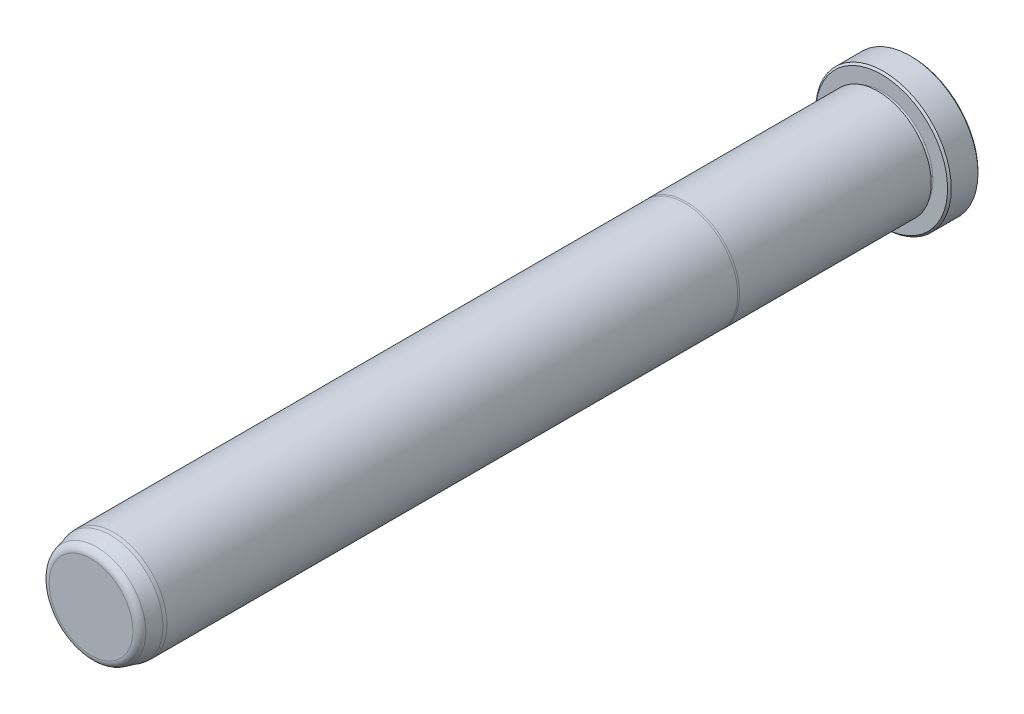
ISO-10303-21;
HEADER;
FILE_DESCRIPTION(('STEP AP214'),'2;1');
FILE_NAME('part.step','',(''),(''),'','','');
FILE_SCHEMA(('AUTOMOTIVE_DESIGN { 1 0 10303 214 1 1 1 1 }'));
ENDSEC;
DATA;
#1=APPLICATION_CONTEXT('core data for automotive mechanical design processes');
#2=APPLICATION_PROTOCOL_DEFINITION('international standard','automotive_design',2000,#1);
#3=PRODUCT_CONTEXT('',#1,'mechanical');
#4=PRODUCT('Part','Part','',(#3));
#5=PRODUCT_RELATED_PRODUCT_CATEGORY('part','',(#4));
#6=PRODUCT_DEFINITION_FORMATION('','',#4);
#7=PRODUCT_DEFINITION_CONTEXT('part definition',#1,'design');
#8=PRODUCT_DEFINITION('design','',#6,#7);
#9=PRODUCT_DEFINITION_SHAPE('','',#8);
#10=(LENGTH_UNIT() NAMED_UNIT(*) SI_UNIT(.MILLI.,.METRE.));
#11=(NAMED_UNIT(*) PLANE_ANGLE_UNIT() SI_UNIT($,.RADIAN.));
#12=(NAMED_UNIT(*) SI_UNIT($,.STERADIAN.) SOLID_ANGLE_UNIT());
#13=UNCERTAINTY_MEASURE_WITH_UNIT(LENGTH_MEASURE(1.E-05),#10,'distance_accuracy_value','');
#14=(GEOMETRIC_REPRESENTATION_CONTEXT(3) GLOBAL_UNCERTAINTY_ASSIGNED_CONTEXT((#13)) GLOBAL_UNIT_ASSIGNED_CONTEXT((#10,
#11,#12)) REPRESENTATION_CONTEXT('',''));
#15=CARTESIAN_POINT('',(0.,0.,0.));
#16=DIRECTION('',(0.,0.,1.));
#17=DIRECTION('',(1.,0.,0.));
#18=AXIS2_PLACEMENT_3D('',#15,#16,#17);
#19=CARTESIAN_POINT('',(0.,0.,0.));
#20=DIRECTION('',(0.,0.,1.));
#21=DIRECTION('',(1.,0.,0.));
#22=AXIS2_PLACEMENT_3D('',#19,#20,#21);
#23=PLANE('',#22);
#24=CARTESIAN_POINT('',(0.,0.,0.));
#25=DIRECTION('',(0.,0.,1.));
#26=DIRECTION('',(1.,0.,0.));
#27=AXIS2_PLACEMENT_3D('',#24,#25,#26);
#28=CIRCLE('',#27,13.7795);
#29=CARTESIAN_POINT('',(13.7795,0.,0.));
#30=VERTEX_POINT('',#29);
#31=EDGE_CURVE('E37',#30,#30,#28,.F.);
#32=ORIENTED_EDGE('',*,*,#31,.T.);
#33=EDGE_LOOP('',(#32));
#34=FACE_BOUND('',#33,.T.);
#35=ADVANCED_FACE('F30',(#34),#23,.F.);
#36=CARTESIAN_POINT('',(0.,0.,0.));
#37=DIRECTION('',(0.,0.,1.));
#38=DIRECTION('',(1.,0.,0.));
#39=AXIS2_PLACEMENT_3D('',#36,#37,#38);
#40=CYLINDRICAL_SURFACE('',#39,14.1605);
#41=CARTESIAN_POINT('',(0.,0.,0.381000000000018));
#42=DIRECTION('',(0.,0.,1.));
#43=DIRECTION('',(1.,0.,0.));
#44=AXIS2_PLACEMENT_3D('',#41,#42,#43);
#45=CIRCLE('',#44,14.1605);
#46=CARTESIAN_POINT('',(14.1605,0.,0.381000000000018));
#47=VERTEX_POINT('',#46);
#48=EDGE_CURVE('E41',#47,#47,#45,.T.);
#49=ORIENTED_EDGE('',*,*,#48,.T.);
#50=EDGE_LOOP('',(#49));
#51=FACE_BOUND('',#50,.T.);
#52=CARTESIAN_POINT('',(0.,0.,5.96900000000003));
#53=DIRECTION('',(0.,0.,-1.));
#54=DIRECTION('',(-1.,0.,0.));
#55=AXIS2_PLACEMENT_3D('',#52,#53,#54);
#56=CIRCLE('',#55,14.1605);
#57=CARTESIAN_POINT('',(-14.1605,0.,5.96900000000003));
#58=VERTEX_POINT('',#57);
#59=EDGE_CURVE('E45',#58,#58,#56,.T.);
#60=ORIENTED_EDGE('',*,*,#59,.T.);
#61=EDGE_LOOP('',(#60));
#62=FACE_BOUND('',#61,.T.);
#63=ADVANCED_FACE('F118',(#51,#62),#40,.T.);
#64=CARTESIAN_POINT('',(0.,14.1605,6.35));
#65=DIRECTION('',(0.,0.,-1.));
#66=DIRECTION('',(-1.,0.,0.));
#67=AXIS2_PLACEMENT_3D('',#64,#65,#66);
#68=PLANE('',#67);
#69=CARTESIAN_POINT('',(0.,0.,6.35));
#70=DIRECTION('',(0.,0.,-1.));
#71=DIRECTION('',(-1.,0.,0.));
#72=AXIS2_PLACEMENT_3D('',#69,#70,#71);
#73=CIRCLE('',#72,13.7795);
#74=CARTESIAN_POINT('',(-13.7795,0.,6.35));
#75=VERTEX_POINT('',#74);
#76=EDGE_CURVE('E10',#75,#75,#73,.F.);
#77=ORIENTED_EDGE('',*,*,#76,.T.);
#78=EDGE_LOOP('',(#77));
#79=FACE_BOUND('',#78,.T.);
#80=CARTESIAN_POINT('',(0.,0.,6.35));
#81=DIRECTION('',(0.,0.,1.));
#82=DIRECTION('',(1.,0.,0.));
#83=AXIS2_PLACEMENT_3D('',#80,#81,#82);
#84=CIRCLE('',#83,10.7188);
#85=CARTESIAN_POINT('',(10.7188,0.,6.35));
#86=VERTEX_POINT('',#85);
#87=EDGE_CURVE('E56',#86,#86,#84,.T.);
#88=ORIENTED_EDGE('',*,*,#87,.F.);
#89=EDGE_LOOP('',(#88));
#90=FACE_BOUND('',#89,.T.);
#91=ADVANCED_FACE('F113',(#79,#90),#68,.F.);
#92=CARTESIAN_POINT('',(0.,0.,6.731));
#93=DIRECTION('',(0.,0.,1.));
#94=DIRECTION('',(1.,0.,0.));
#95=AXIS2_PLACEMENT_3D('',#92,#93,#94);
#96=TOROIDAL_SURFACE('',#95,10.7188,0.381000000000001);
#97=CARTESIAN_POINT('',(0.,0.,7.112));
#98=DIRECTION('',(0.,0.,1.));
#99=DIRECTION('',(1.,0.,0.));
#100=AXIS2_PLACEMENT_3D('',#97,#98,#99);
#101=CIRCLE('',#100,10.7188);
#102=CARTESIAN_POINT('',(10.7188,0.,7.112));
#103=VERTEX_POINT('',#102);
#104=EDGE_CURVE('E59',#103,#103,#101,.T.);
#105=ORIENTED_EDGE('',*,*,#104,.F.);
#106=EDGE_LOOP('',(#105));
#107=FACE_BOUND('',#106,.T.);
#108=ORIENTED_EDGE('',*,*,#87,.T.);
#109=EDGE_LOOP('',(#108));
#110=FACE_BOUND('',#109,.T.);
#111=ADVANCED_FACE('F107',(#107,#110),#96,.F.);
#112=CARTESIAN_POINT('',(0.,10.7188,7.112));
#113=DIRECTION('',(0.,0.,1.));
#114=DIRECTION('',(1.,0.,0.));
#115=AXIS2_PLACEMENT_3D('',#112,#113,#114);
#116=PLANE('',#115);
#117=CARTESIAN_POINT('',(0.,0.,7.112));
#118=DIRECTION('',(0.,0.,1.));
#119=DIRECTION('',(1.,0.,0.));
#120=AXIS2_PLACEMENT_3D('',#117,#118,#119);
#121=CIRCLE('',#120,11.1252);
#122=CARTESIAN_POINT('',(11.1252,0.,7.112));
#123=VERTEX_POINT('',#122);
#124=EDGE_CURVE('E62',#123,#123,#121,.T.);
#125=ORIENTED_EDGE('',*,*,#124,.F.);
#126=EDGE_LOOP('',(#125));
#127=FACE_BOUND('',#126,.T.);
#128=ORIENTED_EDGE('',*,*,#104,.T.);
#129=EDGE_LOOP('',(#128));
#130=FACE_BOUND('',#129,.T.);
#131=ADVANCED_FACE('F101',(#127,#130),#116,.F.);
#132=CARTESIAN_POINT('',(0.,0.,0.));
#133=DIRECTION('',(0.,0.,1.));
#134=DIRECTION('',(1.,0.,0.));
#135=AXIS2_PLACEMENT_3D('',#132,#133,#134);
#136=CYLINDRICAL_SURFACE('',#135,11.1252);
#137=CARTESIAN_POINT('',(0.,0.,47.1347630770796));
#138=DIRECTION('',(0.,0.,1.));
#139=DIRECTION('',(1.,0.,0.));
#140=AXIS2_PLACEMENT_3D('',#137,#138,#139);
#141=CIRCLE('',#140,11.1252);
#142=CARTESIAN_POINT('',(11.1252,0.,47.1347630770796));
#143=VERTEX_POINT('',#142);
#144=EDGE_CURVE('E65',#143,#143,#141,.T.);
#145=ORIENTED_EDGE('',*,*,#144,.F.);
#146=EDGE_LOOP('',(#145));
#147=FACE_BOUND('',#146,.T.);
#148=ORIENTED_EDGE('',*,*,#124,.T.);
#149=EDGE_LOOP('',(#148));
#150=FACE_BOUND('',#149,.T.);
#151=ADVANCED_FACE('F95',(#147,#150),#136,.T.);
#152=CARTESIAN_POINT('',(0.,0.,47.1347630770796));
#153=DIRECTION('',(0.,0.,-1.));
#154=DIRECTION('',(-1.,0.,0.));
#155=AXIS2_PLACEMENT_3D('',#152,#153,#154);
#156=CONICAL_SURFACE('',#155,11.1252,0.0698131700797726);
#157=CARTESIAN_POINT('',(0.,0.,47.498));
#158=DIRECTION('',(0.,0.,1.));
#159=DIRECTION('',(1.,0.,0.));
#160=AXIS2_PLACEMENT_3D('',#157,#158,#159);
#161=CIRCLE('',#160,11.0998);
#162=CARTESIAN_POINT('',(11.0998,0.,47.498));
#163=VERTEX_POINT('',#162);
#164=EDGE_CURVE('E68',#163,#163,#161,.T.);
#165=ORIENTED_EDGE('',*,*,#164,.F.);
#166=EDGE_LOOP('',(#165));
#167=FACE_BOUND('',#166,.T.);
#168=ORIENTED_EDGE('',*,*,#144,.T.);
#169=EDGE_LOOP('',(#168));
#170=FACE_BOUND('',#169,.T.);
#171=ADVANCED_FACE('F89',(#167,#170),#156,.T.);
#172=CARTESIAN_POINT('',(0.,0.,0.));
#173=DIRECTION('',(0.,0.,1.));
#174=DIRECTION('',(1.,0.,0.));
#175=AXIS2_PLACEMENT_3D('',#172,#173,#174);
#176=CYLINDRICAL_SURFACE('',#175,11.0998);
#177=CARTESIAN_POINT('',(0.,0.,166.6875));
#178=DIRECTION('',(0.,0.,1.));
#179=DIRECTION('',(1.,0.,0.));
#180=AXIS2_PLACEMENT_3D('',#177,#178,#179);
#181=CIRCLE('',#180,11.0998);
#182=CARTESIAN_POINT('',(11.0998,0.,166.6875));
#183=VERTEX_POINT('',#182);
#184=EDGE_CURVE('E71',#183,#183,#181,.T.);
#185=ORIENTED_EDGE('',*,*,#184,.F.);
#186=EDGE_LOOP('',(#185));
#187=FACE_BOUND('',#186,.T.);
#188=ORIENTED_EDGE('',*,*,#164,.T.);
#189=EDGE_LOOP('',(#188));
#190=FACE_BOUND('',#189,.T.);
#191=ADVANCED_FACE('F83',(#187,#190),#176,.T.);
#192=CARTESIAN_POINT('',(0.,0.,166.6875));
#193=DIRECTION('',(0.,0.,-1.));
#194=DIRECTION('',(-1.,0.,0.));
#195=AXIS2_PLACEMENT_3D('',#192,#193,#194);
#196=CONICAL_SURFACE('',#195,11.0998,0.0872664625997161);
#197=CARTESIAN_POINT('',(0.,0.,167.4495));
#198=DIRECTION('',(0.,0.,1.));
#199=DIRECTION('',(1.,0.,0.));
#200=AXIS2_PLACEMENT_3D('',#197,#198,#199);
#201=CIRCLE('',#200,11.0331336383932);
#202=CARTESIAN_POINT('',(11.0331336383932,0.,167.4495));
#203=VERTEX_POINT('',#202);
#204=EDGE_CURVE('E74',#203,#203,#201,.T.);
#205=ORIENTED_EDGE('',*,*,#204,.F.);
#206=EDGE_LOOP('',(#205));
#207=FACE_BOUND('',#206,.T.);
#208=ORIENTED_EDGE('',*,*,#184,.T.);
#209=EDGE_LOOP('',(#208));
#210=FACE_BOUND('',#209,.T.);
#211=ADVANCED_FACE('F80',(#207,#210),#196,.T.);
#212=CARTESIAN_POINT('',(0.,0.,167.4495));
#213=DIRECTION('',(0.,0.,-1.));
#214=DIRECTION('',(-1.,0.,0.));
#215=AXIS2_PLACEMENT_3D('',#212,#213,#214);
#216=CONICAL_SURFACE('',#215,11.0331336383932,0.26179938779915);
#217=CARTESIAN_POINT('',(0.,0.,170.2733752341));
#218=DIRECTION('',(0.,0.,1.));
#219=DIRECTION('',(1.,0.,0.));
#220=AXIS2_PLACEMENT_3D('',#217,#218,#219);
#221=CIRCLE('',#220,10.2764785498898);
#222=CARTESIAN_POINT('',(10.2764785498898,0.,170.2733752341));
#223=VERTEX_POINT('',#222);
#224=EDGE_CURVE('E50',#223,#223,#221,.F.);
#225=ORIENTED_EDGE('',*,*,#224,.T.);
#226=EDGE_LOOP('',(#225));
#227=FACE_BOUND('',#226,.T.);
#228=ORIENTED_EDGE('',*,*,#204,.T.);
#229=EDGE_LOOP('',(#228));
#230=FACE_BOUND('',#229,.T.);
#231=ADVANCED_FACE('F78',(#227,#230),#216,.T.);
#232=CARTESIAN_POINT('',(0.,9.96120289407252,171.45));
#233=DIRECTION('',(0.,0.,-1.));
#234=DIRECTION('',(-1.,0.,0.));
#235=AXIS2_PLACEMENT_3D('',#232,#233,#234);
#236=PLANE('',#235);
#237=CARTESIAN_POINT('',(0.,0.,171.45));
#238=DIRECTION('',(0.,0.,-1.));
#239=DIRECTION('',(-1.,0.,0.));
#240=AXIS2_PLACEMENT_3D('',#237,#238,#239);
#241=CIRCLE('',#240,8.74307130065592);
#242=CARTESIAN_POINT('',(-8.74307130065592,0.,171.45));
#243=VERTEX_POINT('',#242);
#244=EDGE_CURVE('E53',#243,#243,#241,.F.);
#245=ORIENTED_EDGE('',*,*,#244,.T.);
#246=EDGE_LOOP('',(#245));
#247=FACE_BOUND('',#246,.T.);
#248=ADVANCED_FACE('F133',(#247),#236,.F.);
#249=CARTESIAN_POINT('',(0.,0.,169.8625));
#250=DIRECTION('',(0.,0.,-1.));
#251=DIRECTION('',(-1.,0.,0.));
#252=AXIS2_PLACEMENT_3D('',#249,#250,#251);
#253=TOROIDAL_SURFACE('',#252,8.74307130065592,1.5875);
#254=ORIENTED_EDGE('',*,*,#224,.F.);
#255=EDGE_LOOP('',(#254));
#256=FACE_BOUND('',#255,.T.);
#257=ORIENTED_EDGE('',*,*,#244,.F.);
#258=EDGE_LOOP('',(#257));
#259=FACE_BOUND('',#258,.T.);
#260=ADVANCED_FACE('F130',(#256,#259),#253,.T.);
#261=CARTESIAN_POINT('',(0.,0.,0.381000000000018));
#262=DIRECTION('',(0.,0.,1.));
#263=DIRECTION('',(1.,0.,0.));
#264=AXIS2_PLACEMENT_3D('',#261,#262,#263);
#265=CONICAL_SURFACE('',#264,14.1605,0.785398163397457);
#266=CARTESIAN_POINT('',(13.7795,0.,0.));
#267=CARTESIAN_POINT('',(13.78346875,0.,0.00396875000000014));
#268=CARTESIAN_POINT('',(13.7874375,0.,0.00793750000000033));
#269=CARTESIAN_POINT('',(13.795375,0.,0.0158750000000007));
#270=CARTESIAN_POINT('',(13.79934375,0.,0.0198437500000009));
#271=CARTESIAN_POINT('',(13.80728125,0.,0.0277812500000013));
#272=CARTESIAN_POINT('',(13.81125,0.,0.0317500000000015));
#273=CARTESIAN_POINT('',(13.8191875,0.,0.0396875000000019));
#274=CARTESIAN_POINT('',(13.82315625,0.,0.043656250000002));
#275=CARTESIAN_POINT('',(13.83109375,0.,0.0515937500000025));
#276=CARTESIAN_POINT('',(13.8350625,0.,0.0555625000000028));
#277=CARTESIAN_POINT('',(13.843,0.,0.0635000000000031));
#278=CARTESIAN_POINT('',(13.84696875,0.,0.0674687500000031));
#279=CARTESIAN_POINT('',(13.85490625,0.,0.0754062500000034));
#280=CARTESIAN_POINT('',(13.858875,0.,0.0793750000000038));
#281=CARTESIAN_POINT('',(13.8668125,0.,0.0873125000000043));
#282=CARTESIAN_POINT('',(13.87078125,0.,0.0912812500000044));
#283=CARTESIAN_POINT('',(13.87871875,0.,0.0992187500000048));
#284=CARTESIAN_POINT('',(13.8826875,0.,0.103187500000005));
#285=CARTESIAN_POINT('',(13.890625,0.,0.111125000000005));
#286=CARTESIAN_POINT('',(13.89459375,0.,0.115093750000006));
#287=CARTESIAN_POINT('',(13.90253125,0.,0.123031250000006));
#288=CARTESIAN_POINT('',(13.9065,0.,0.127000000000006));
#289=CARTESIAN_POINT('',(13.9144375,0.,0.134937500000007));
#290=CARTESIAN_POINT('',(13.91840625,0.,0.138906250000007));
#291=CARTESIAN_POINT('',(13.92634375,0.,0.146843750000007));
#292=CARTESIAN_POINT('',(13.9303125,0.,0.150812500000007));
#293=CARTESIAN_POINT('',(13.93825,0.,0.158750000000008));
#294=CARTESIAN_POINT('',(13.94221875,0.,0.162718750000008));
#295=CARTESIAN_POINT('',(13.95015625,0.,0.170656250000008));
#296=CARTESIAN_POINT('',(13.954125,0.,0.174625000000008));
#297=CARTESIAN_POINT('',(13.9620625,0.,0.182562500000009));
#298=CARTESIAN_POINT('',(13.96603125,0.,0.186531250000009));
#299=CARTESIAN_POINT('',(13.97396875,0.,0.19446875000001));
#300=CARTESIAN_POINT('',(13.9779375,0.,0.198437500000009));
#301=CARTESIAN_POINT('',(13.985875,0.,0.20637500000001));
#302=CARTESIAN_POINT('',(13.98984375,0.,0.21034375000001));
#303=CARTESIAN_POINT('',(13.99778125,0.,0.218281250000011));
#304=CARTESIAN_POINT('',(14.00175,0.,0.222250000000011));
#305=CARTESIAN_POINT('',(14.0096875,0.,0.230187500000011));
#306=CARTESIAN_POINT('',(14.01365625,0.,0.234156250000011));
#307=CARTESIAN_POINT('',(14.02159375,0.,0.242093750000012));
#308=CARTESIAN_POINT('',(14.0255625,0.,0.246062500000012));
#309=CARTESIAN_POINT('',(14.0335,0.,0.254000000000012));
#310=CARTESIAN_POINT('',(14.03746875,0.,0.257968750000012));
#311=CARTESIAN_POINT('',(14.04540625,0.,0.265906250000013));
#312=CARTESIAN_POINT('',(14.049375,0.,0.269875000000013));
#313=CARTESIAN_POINT('',(14.0573125,0.,0.277812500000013));
#314=CARTESIAN_POINT('',(14.06128125,0.,0.281781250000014));
#315=CARTESIAN_POINT('',(14.06921875,0.,0.289718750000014));
#316=CARTESIAN_POINT('',(14.0731875,0.,0.293687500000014));
#317=CARTESIAN_POINT('',(14.081125,0.,0.301625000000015));
#318=CARTESIAN_POINT('',(14.08509375,0.,0.305593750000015));
#319=CARTESIAN_POINT('',(14.09303125,0.,0.313531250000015));
#320=CARTESIAN_POINT('',(14.097,0.,0.317500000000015));
#321=CARTESIAN_POINT('',(14.1049375,0.,0.325437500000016));
#322=CARTESIAN_POINT('',(14.10890625,0.,0.329406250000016));
#323=CARTESIAN_POINT('',(14.11684375,0.,0.337343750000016));
#324=CARTESIAN_POINT('',(14.1208125,0.,0.341312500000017));
#325=CARTESIAN_POINT('',(14.12875,0.,0.349250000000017));
#326=CARTESIAN_POINT('',(14.13271875,0.,0.353218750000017));
#327=CARTESIAN_POINT('',(14.14065625,0.,0.361156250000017));
#328=CARTESIAN_POINT('',(14.144625,0.,0.365125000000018));
#329=CARTESIAN_POINT('',(14.1525625,0.,0.373062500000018));
#330=CARTESIAN_POINT('',(14.15653125,0.,0.377031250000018));
#331=CARTESIAN_POINT('',(14.1605,0.,0.381000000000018));
#332=B_SPLINE_CURVE_WITH_KNOTS('',3,(#266,#267,#268,#269,#270,#271,#272,#273,#274,#275,#276,
#277,#278,#279,#280,#281,#282,#283,#284,#285,#286,#287,#288,#289,#290,#291,#292,#293,#294,#295,
#296,#297,#298,#299,#300,#301,#302,#303,#304,#305,#306,#307,#308,#309,#310,#311,#312,#313,#314,
#315,#316,#317,#318,#319,#320,#321,#322,#323,#324,#325,#326,#327,#328,#329,#330,#331),
.UNSPECIFIED.,.F.,.F.,(4,2,2,2,2,2,2,2,2,2,2,2,2,2,2,2,2,2,2,2,2,2,2,2,2,2,2,2,2,2,2,2,4),(0.,
0.0168379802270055,0.033675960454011,0.0505139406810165,0.0673519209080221,0.0841899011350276,
0.101027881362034,0.11786586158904,0.134703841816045,0.151541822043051,0.168379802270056,
0.185217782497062,0.202055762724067,0.218893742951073,0.235731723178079,0.252569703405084,
0.26940768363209,0.286245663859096,0.303083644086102,0.319921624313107,0.336759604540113,
0.353597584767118,0.370435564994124,0.387273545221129,0.404111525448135,0.420949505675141,
0.437787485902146,0.454625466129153,0.471463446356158,0.488301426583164,0.505139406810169,
0.521977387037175,0.53881536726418),.UNSPECIFIED.);
#333=EDGE_CURVE('BSEAM132',#30,#47,#332,.T.);
#334=ORIENTED_EDGE('',*,*,#31,.F.);
#335=ORIENTED_EDGE('',*,*,#48,.F.);
#336=ORIENTED_EDGE('',*,*,#333,.T.);
#337=ORIENTED_EDGE('',*,*,#333,.F.);
#338=EDGE_LOOP('',(#334,#336,#335,#337));
#339=FACE_BOUND('',#338,.T.);
#340=ADVANCED_FACE('F132',(#339),#265,.T.);
#341=CARTESIAN_POINT('',(0.,0.,6.35));
#342=DIRECTION('',(0.,0.,-1.));
#343=DIRECTION('',(-1.,0.,0.));
#344=AXIS2_PLACEMENT_3D('',#341,#342,#343);
#345=CONICAL_SURFACE('',#344,13.7795,0.785398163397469);
#346=ORIENTED_EDGE('',*,*,#59,.F.);
#347=EDGE_LOOP('',(#346));
#348=FACE_BOUND('',#347,.T.);
#349=ORIENTED_EDGE('',*,*,#76,.F.);
#350=EDGE_LOOP('',(#349));
#351=FACE_BOUND('',#350,.T.);
#352=ADVANCED_FACE('F32',(#348,#351),#345,.T.);
#353=CLOSED_SHELL('',(#35,#63,#91,#111,#131,#151,#171,#191,#211,#231,#248,#260,#340,#352));
#354=MANIFOLD_SOLID_BREP('B2',#353);
#355=ADVANCED_BREP_SHAPE_REPRESENTATION('',(#18,#354),#14);
#356=SHAPE_DEFINITION_REPRESENTATION(#9,#355);
ENDSEC;
END-ISO-10303-21;
